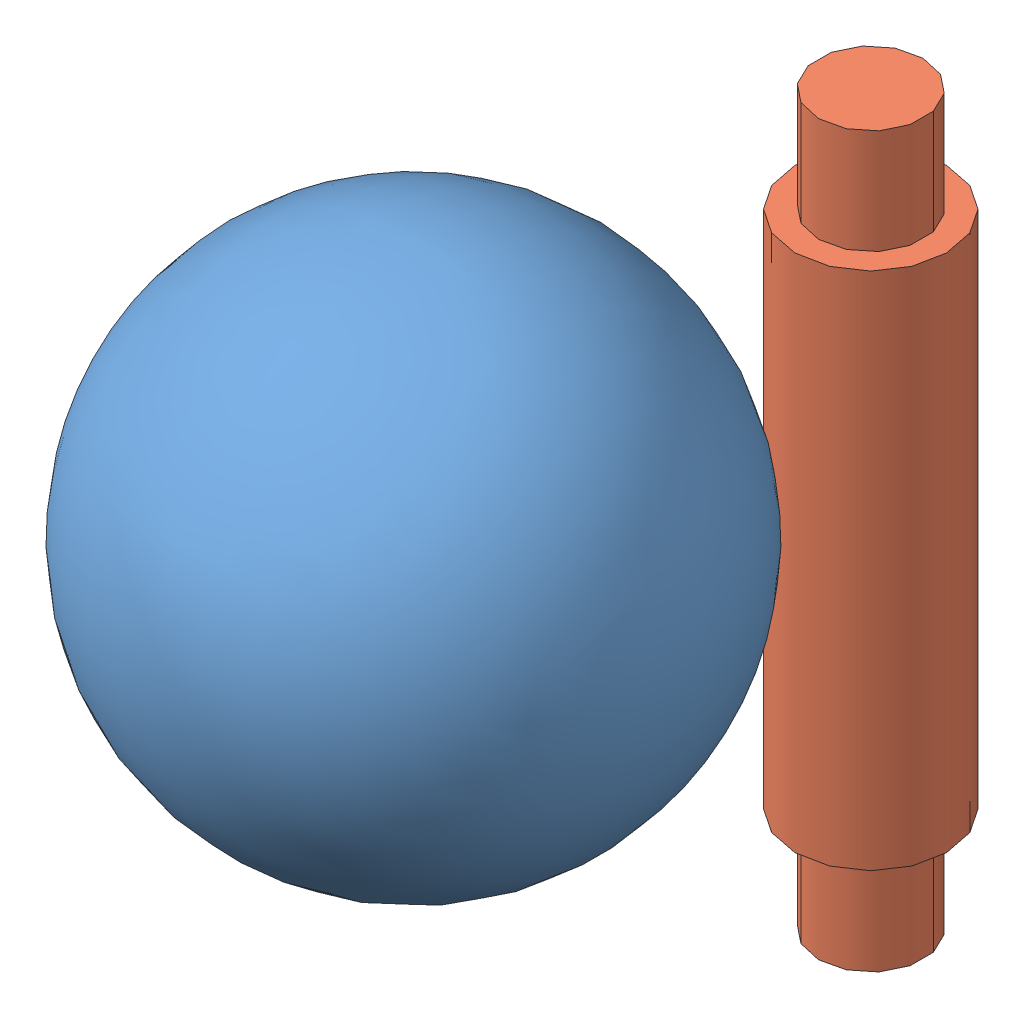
SolidWorks assembly tangent mate.SLDASM, configuration Default (file format 6000). Lengths in mm.
Overall size (150 210.19 181.3).
2 component instances, 2 part files, 1 mates.
Components (placement in the parent):
- sphere-1: sphere.SLDPRT [Default] at origin size (150 150 150)
- end pin-1: end pin.SLDPRT [Default] at (47.5304 -11.0483 -84.42) size (43.76 210.19 43.76)
Mates (geometry in assembly coordinates):
- Tangent4: tangent anti-aligned: sphere of assembly
